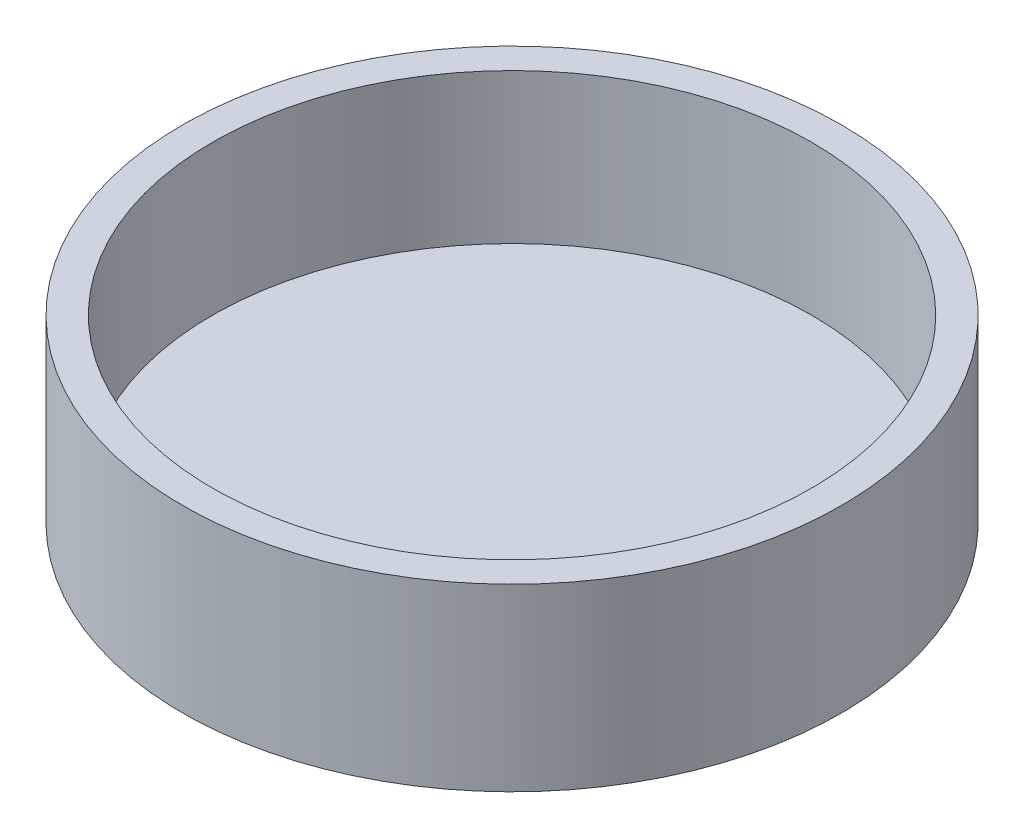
ISO-10303-21;
HEADER;
FILE_DESCRIPTION(('STEP AP214'),'2;1');
FILE_NAME('part.step','',(''),(''),'','','');
FILE_SCHEMA(('AUTOMOTIVE_DESIGN { 1 0 10303 214 1 1 1 1 }'));
ENDSEC;
DATA;
#1=APPLICATION_CONTEXT('core data for automotive mechanical design processes');
#2=APPLICATION_PROTOCOL_DEFINITION('international standard','automotive_design',2000,#1);
#3=PRODUCT_CONTEXT('',#1,'mechanical');
#4=PRODUCT('Part','Part','',(#3));
#5=PRODUCT_RELATED_PRODUCT_CATEGORY('part','',(#4));
#6=PRODUCT_DEFINITION_FORMATION('','',#4);
#7=PRODUCT_DEFINITION_CONTEXT('part definition',#1,'design');
#8=PRODUCT_DEFINITION('design','',#6,#7);
#9=PRODUCT_DEFINITION_SHAPE('','',#8);
#10=(LENGTH_UNIT() NAMED_UNIT(*) SI_UNIT(.MILLI.,.METRE.));
#11=(NAMED_UNIT(*) PLANE_ANGLE_UNIT() SI_UNIT($,.RADIAN.));
#12=(NAMED_UNIT(*) SI_UNIT($,.STERADIAN.) SOLID_ANGLE_UNIT());
#13=UNCERTAINTY_MEASURE_WITH_UNIT(LENGTH_MEASURE(1.E-05),#10,'distance_accuracy_value','');
#14=(GEOMETRIC_REPRESENTATION_CONTEXT(3) GLOBAL_UNCERTAINTY_ASSIGNED_CONTEXT((#13)) GLOBAL_UNIT_ASSIGNED_CONTEXT((#10,
#11,#12)) REPRESENTATION_CONTEXT('',''));
#15=CARTESIAN_POINT('',(0.,0.,0.));
#16=DIRECTION('',(0.,0.,1.));
#17=DIRECTION('',(1.,0.,0.));
#18=AXIS2_PLACEMENT_3D('',#15,#16,#17);
#19=CARTESIAN_POINT('',(-127.,76.2,0.));
#20=DIRECTION('',(0.,-1.,0.));
#21=DIRECTION('',(0.,0.,-1.));
#22=AXIS2_PLACEMENT_3D('',#19,#20,#21);
#23=PLANE('',#22);
#24=CARTESIAN_POINT('',(0.,76.2,0.));
#25=DIRECTION('',(0.,-1.,0.));
#26=DIRECTION('',(0.,0.,-1.));
#27=AXIS2_PLACEMENT_3D('',#24,#25,#26);
#28=CIRCLE('',#27,139.7);
#29=CARTESIAN_POINT('',(0.,76.2,-139.7));
#30=VERTEX_POINT('',#29);
#31=EDGE_CURVE('E10',#30,#30,#28,.T.);
#32=ORIENTED_EDGE('',*,*,#31,.F.);
#33=EDGE_LOOP('',(#32));
#34=FACE_BOUND('',#33,.T.);
#35=CARTESIAN_POINT('',(0.,76.2,0.));
#36=DIRECTION('',(0.,-1.,0.));
#37=DIRECTION('',(0.,0.,-1.));
#38=AXIS2_PLACEMENT_3D('',#35,#36,#37);
#39=CIRCLE('',#38,127.);
#40=CARTESIAN_POINT('',(0.,76.2,-127.));
#41=VERTEX_POINT('',#40);
#42=EDGE_CURVE('E44',#41,#41,#39,.T.);
#43=ORIENTED_EDGE('',*,*,#42,.T.);
#44=EDGE_LOOP('',(#43));
#45=FACE_BOUND('',#44,.T.);
#46=ADVANCED_FACE('F30',(#34,#45),#23,.F.);
#47=CARTESIAN_POINT('',(0.,0.,0.));
#48=DIRECTION('',(0.,-1.,0.));
#49=DIRECTION('',(0.,0.,-1.));
#50=AXIS2_PLACEMENT_3D('',#47,#48,#49);
#51=CYLINDRICAL_SURFACE('',#50,139.7);
#52=CARTESIAN_POINT('',(0.,0.,0.));
#53=DIRECTION('',(0.,-1.,0.));
#54=DIRECTION('',(0.,0.,-1.));
#55=AXIS2_PLACEMENT_3D('',#52,#53,#54);
#56=CIRCLE('',#55,139.7);
#57=CARTESIAN_POINT('',(0.,0.,-139.7));
#58=VERTEX_POINT('',#57);
#59=EDGE_CURVE('E36',#58,#58,#56,.T.);
#60=ORIENTED_EDGE('',*,*,#59,.F.);
#61=EDGE_LOOP('',(#60));
#62=FACE_BOUND('',#61,.T.);
#63=ORIENTED_EDGE('',*,*,#31,.T.);
#64=EDGE_LOOP('',(#63));
#65=FACE_BOUND('',#64,.T.);
#66=ADVANCED_FACE('F64',(#62,#65),#51,.T.);
#67=CARTESIAN_POINT('',(-139.7,0.,0.));
#68=DIRECTION('',(0.,1.,0.));
#69=DIRECTION('',(0.,0.,1.));
#70=AXIS2_PLACEMENT_3D('',#67,#68,#69);
#71=PLANE('',#70);
#72=ORIENTED_EDGE('',*,*,#59,.T.);
#73=EDGE_LOOP('',(#72));
#74=FACE_BOUND('',#73,.T.);
#75=ADVANCED_FACE('F59',(#74),#71,.F.);
#76=CARTESIAN_POINT('',(0.,12.7,0.));
#77=DIRECTION('',(0.,-1.,0.));
#78=DIRECTION('',(0.,0.,-1.));
#79=AXIS2_PLACEMENT_3D('',#76,#77,#78);
#80=PLANE('',#79);
#81=CARTESIAN_POINT('',(0.,12.7,0.));
#82=DIRECTION('',(0.,-1.,0.));
#83=DIRECTION('',(0.,0.,-1.));
#84=AXIS2_PLACEMENT_3D('',#81,#82,#83);
#85=CIRCLE('',#84,127.);
#86=CARTESIAN_POINT('',(0.,12.7,-127.));
#87=VERTEX_POINT('',#86);
#88=EDGE_CURVE('E40',#87,#87,#85,.T.);
#89=ORIENTED_EDGE('',*,*,#88,.F.);
#90=EDGE_LOOP('',(#89));
#91=FACE_BOUND('',#90,.T.);
#92=ADVANCED_FACE('F54',(#91),#80,.F.);
#93=CARTESIAN_POINT('',(0.,0.,0.));
#94=DIRECTION('',(0.,-1.,0.));
#95=DIRECTION('',(0.,0.,-1.));
#96=AXIS2_PLACEMENT_3D('',#93,#94,#95);
#97=CYLINDRICAL_SURFACE('',#96,127.);
#98=ORIENTED_EDGE('',*,*,#42,.F.);
#99=EDGE_LOOP('',(#98));
#100=FACE_BOUND('',#99,.T.);
#101=ORIENTED_EDGE('',*,*,#88,.T.);
#102=EDGE_LOOP('',(#101));
#103=FACE_BOUND('',#102,.T.);
#104=ADVANCED_FACE('F51',(#100,#103),#97,.F.);
#105=CLOSED_SHELL('',(#46,#66,#75,#92,#104));
#106=MANIFOLD_SOLID_BREP('B2',#105);
#107=ADVANCED_BREP_SHAPE_REPRESENTATION('',(#18,#106),#14);
#108=SHAPE_DEFINITION_REPRESENTATION(#9,#107);
ENDSEC;
END-ISO-10303-21;
